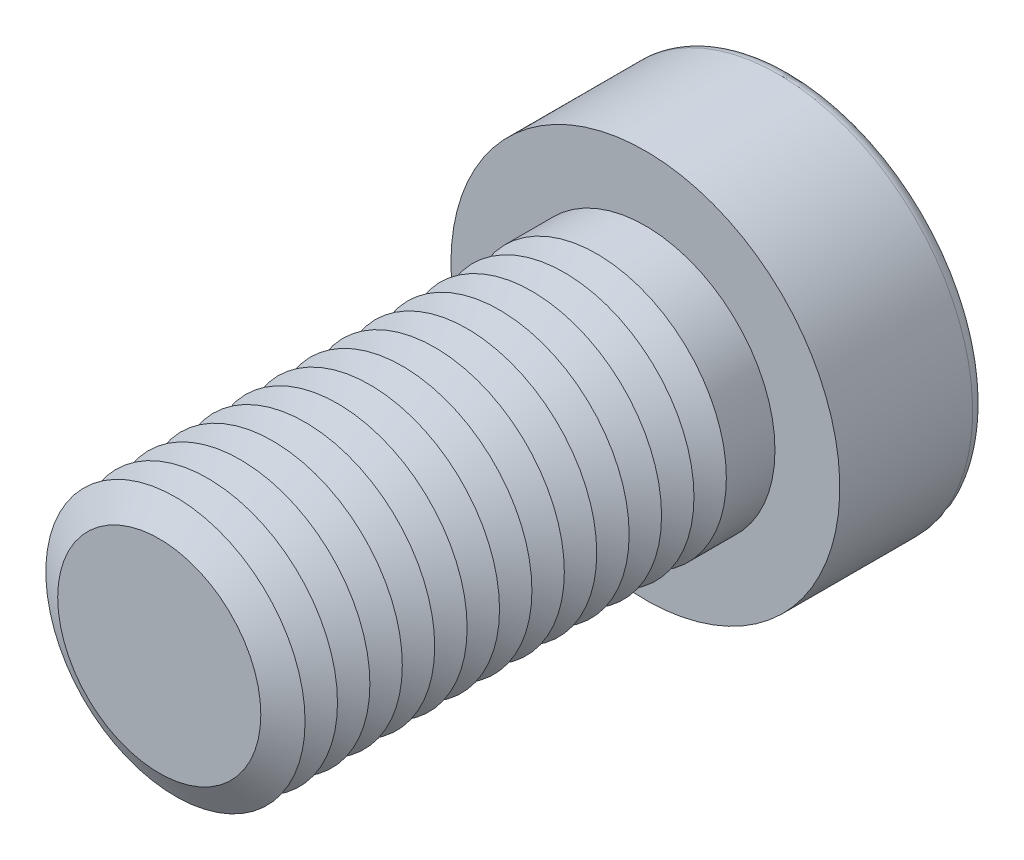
from build123d import *

# Parameters (mm, degrees)
SKETCH1_R           = 8
BOSS_EXTRUDE1_DEPTH = 30
SKETCH2_R           = 12
BOSS_EXTRUDE2_DEPTH = 9
CUT_EXTRUDE1_DEPTH  = 9
FILLET1_R           = 0.8
LPATTERN1_COUNT     = 14
LPATTERN1_PITCH     = 2


with BuildPart() as part:
    # Sketch1 → Boss-Extrude1 (new body)
    with BuildSketch(Plane.XY):
        Circle(SKETCH1_R)
    extrude(amount=BOSS_EXTRUDE1_DEPTH)

    # Sketch2 → Boss-Extrude2 (add)
    with BuildSketch(Plane(origin=(0, 0, 0), x_dir=(-1, 0, 0), z_dir=(0, 0, -1))):
        Circle(SKETCH2_R)
    extrude(amount=BOSS_EXTRUDE2_DEPTH)

    # Sketch3 → Cut-Extrude1 (cut)
    with BuildSketch(Plane(origin=(0, 0, -9), x_dir=(-1, 0, 0), z_dir=(0, 0, -1))):
        Polygon((-3.464101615, 6), (-6.92820323, 0), (-3.464101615, -6), (3.464101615, -6), (6.92820323, 0), (3.464101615, 6), align=None)
    extrude(amount=-CUT_EXTRUDE1_DEPTH, mode=Mode.SUBTRACT)

    # Fillet1
    fillet1_edges = [part.edges().sort_by_distance(p)[0] for p in [
        (12, 0, -9),
    ]]
    fillet(fillet1_edges, radius=FILLET1_R)

    # Cut-Extrude2 cone 1 section (on through the dimple's axis) → Cut-Extrude2 (revolve, cut)
    with BuildSketch(Plane.YZ):
        Polygon((0, 0), (6, 0), (0, 3.464101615), align=None)
    revolve(axis=Axis((0, 0, 0), (0, 0, 1)), mode=Mode.SUBTRACT)

    # Cut-Extrude3 cone 1 section (on through the dimple's axis) → Cut-Extrude3 (revolve, cut)
    with BuildSketch(Plane(origin=(0, 0, -9), x_dir=(0, 1, 0), z_dir=(1, 0, 0))):
        Polygon((0, 0), (6.92820323, 0), (0, 1.856406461), align=None)
    revolve(axis=Axis((0, 0, -9), (0, 0, 1)), mode=Mode.SUBTRACT)

    # Sketch7 → Cut-Revolve1 (revolve, cut)
    with BuildSketch(Plane(origin=(0, 0, 0), x_dir=(0, 0, -1), z_dir=(1, 0, 0)), mode=Mode.PRIVATE) as cut_revolve1_sk:
        Polygon((-30, 6.267949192), (-29, 8), (-31, 8), align=None)
    cut_revolve1 = revolve(cut_revolve1_sk.sketch.rotate(Axis((0, 0, 30), (0, 0, -1)), 90), axis=Axis((0, 0, 30), (0, 0, -1)), mode=Mode.SUBTRACT)

    # LPattern1: Cut-Revolve1 ×14
    with Locations(*[(0, 0, -i * LPATTERN1_PITCH) for i in range(1, LPATTERN1_COUNT)]):
        add(cut_revolve1, mode=Mode.SUBTRACT)


solid = part.part
